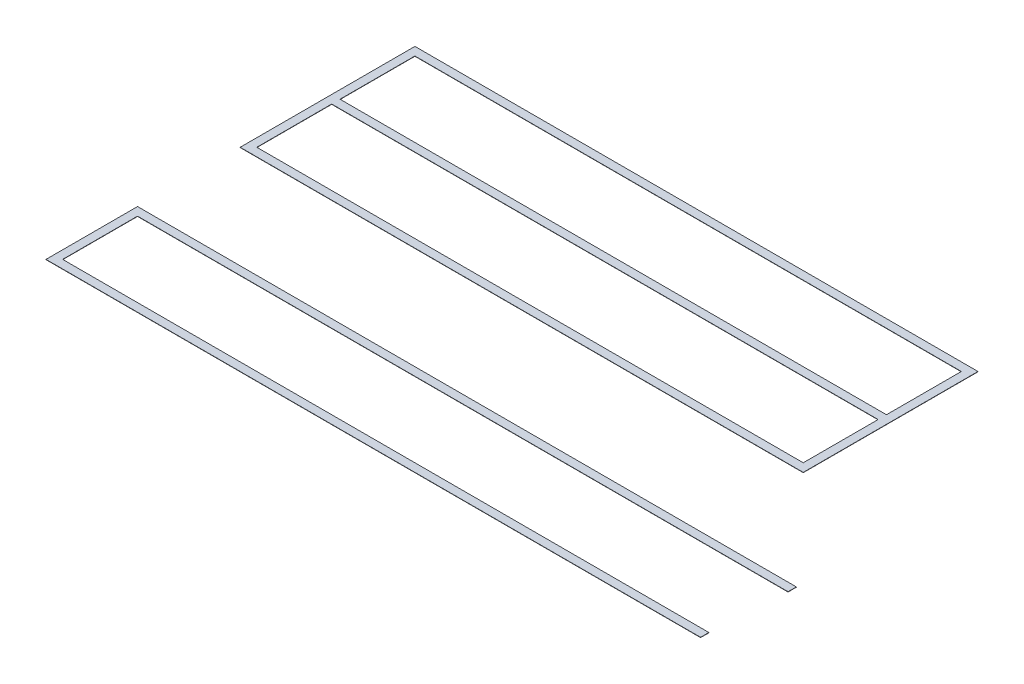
ISO-10303-21;
HEADER;
FILE_DESCRIPTION(('STEP AP214'),'2;1');
FILE_NAME('part.step','',(''),(''),'','','');
FILE_SCHEMA(('AUTOMOTIVE_DESIGN { 1 0 10303 214 1 1 1 1 }'));
ENDSEC;
DATA;
#1=APPLICATION_CONTEXT('core data for automotive mechanical design processes');
#2=APPLICATION_PROTOCOL_DEFINITION('international standard','automotive_design',2000,#1);
#3=PRODUCT_CONTEXT('',#1,'mechanical');
#4=PRODUCT('Part','Part','',(#3));
#5=PRODUCT_RELATED_PRODUCT_CATEGORY('part','',(#4));
#6=PRODUCT_DEFINITION_FORMATION('','',#4);
#7=PRODUCT_DEFINITION_CONTEXT('part definition',#1,'design');
#8=PRODUCT_DEFINITION('design','',#6,#7);
#9=PRODUCT_DEFINITION_SHAPE('','',#8);
#10=(LENGTH_UNIT() NAMED_UNIT(*) SI_UNIT(.MILLI.,.METRE.));
#11=(NAMED_UNIT(*) PLANE_ANGLE_UNIT() SI_UNIT($,.RADIAN.));
#12=(NAMED_UNIT(*) SI_UNIT($,.STERADIAN.) SOLID_ANGLE_UNIT());
#13=UNCERTAINTY_MEASURE_WITH_UNIT(LENGTH_MEASURE(1.E-05),#10,'distance_accuracy_value','');
#14=(GEOMETRIC_REPRESENTATION_CONTEXT(3) GLOBAL_UNCERTAINTY_ASSIGNED_CONTEXT((#13)) GLOBAL_UNIT_ASSIGNED_CONTEXT((#10,
#11,#12)) REPRESENTATION_CONTEXT('',''));
#15=CARTESIAN_POINT('',(0.,0.,0.));
#16=DIRECTION('',(0.,0.,1.));
#17=DIRECTION('',(1.,0.,0.));
#18=AXIS2_PLACEMENT_3D('',#15,#16,#17);
#19=CARTESIAN_POINT('',(-1015.,1.,185.));
#20=DIRECTION('',(1.,0.,0.));
#21=DIRECTION('',(0.,0.,-1.));
#22=AXIS2_PLACEMENT_3D('',#19,#20,#21);
#23=PLANE('',#22);
#24=DIRECTION('',(0.,0.,1.));
#25=VECTOR('',#24,1.);
#26=CARTESIAN_POINT('',(-1015.,0.,185.));
#27=LINE('',#26,#25);
#28=CARTESIAN_POINT('',(-1015.,0.,185.));
#29=VERTEX_POINT('',#28);
#30=CARTESIAN_POINT('',(-1015.,0.,515.));
#31=VERTEX_POINT('',#30);
#32=EDGE_CURVE('E104',#29,#31,#27,.T.);
#33=ORIENTED_EDGE('',*,*,#32,.T.);
#34=DIRECTION('',(0.,-1.,0.));
#35=VECTOR('',#34,1.);
#36=CARTESIAN_POINT('',(-1015.,1.,515.));
#37=LINE('',#36,#35);
#38=CARTESIAN_POINT('',(-1015.,1.,515.));
#39=VERTEX_POINT('',#38);
#40=EDGE_CURVE('E12',#39,#31,#37,.T.);
#41=ORIENTED_EDGE('',*,*,#40,.F.);
#42=DIRECTION('',(0.,0.,1.));
#43=VECTOR('',#42,1.);
#44=CARTESIAN_POINT('',(-1015.,1.,185.));
#45=LINE('',#44,#43);
#46=CARTESIAN_POINT('',(-1015.,1.,185.));
#47=VERTEX_POINT('',#46);
#48=EDGE_CURVE('E131',#47,#39,#45,.T.);
#49=ORIENTED_EDGE('',*,*,#48,.F.);
#50=DIRECTION('',(0.,-1.,0.));
#51=VECTOR('',#50,1.);
#52=CARTESIAN_POINT('',(-1015.,1.,185.));
#53=LINE('',#52,#51);
#54=EDGE_CURVE('E117',#47,#29,#53,.T.);
#55=ORIENTED_EDGE('',*,*,#54,.T.);
#56=EDGE_LOOP('',(#33,#41,#49,#55));
#57=FACE_BOUND('',#56,.T.);
#58=ADVANCED_FACE('F36',(#57),#23,.F.);
#59=CARTESIAN_POINT('',(-1015.,1.,515.));
#60=DIRECTION('',(0.,0.,-1.));
#61=DIRECTION('',(-1.,0.,0.));
#62=AXIS2_PLACEMENT_3D('',#59,#60,#61);
#63=PLANE('',#62);
#64=DIRECTION('',(1.,0.,0.));
#65=VECTOR('',#64,1.);
#66=CARTESIAN_POINT('',(-1015.,0.,515.));
#67=LINE('',#66,#65);
#68=CARTESIAN_POINT('',(1344.86822087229,0.,515.));
#69=VERTEX_POINT('',#68);
#70=EDGE_CURVE('E100',#31,#69,#67,.T.);
#71=ORIENTED_EDGE('',*,*,#70,.T.);
#72=DIRECTION('',(0.,-1.,0.));
#73=VECTOR('',#72,1.);
#74=CARTESIAN_POINT('',(1344.86822087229,1.,515.));
#75=LINE('',#74,#73);
#76=CARTESIAN_POINT('',(1344.86822087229,1.,515.));
#77=VERTEX_POINT('',#76);
#78=EDGE_CURVE('E43',#77,#69,#75,.T.);
#79=ORIENTED_EDGE('',*,*,#78,.F.);
#80=DIRECTION('',(1.,0.,0.));
#81=VECTOR('',#80,1.);
#82=CARTESIAN_POINT('',(-1015.,1.,515.));
#83=LINE('',#82,#81);
#84=EDGE_CURVE('E113',#39,#77,#83,.T.);
#85=ORIENTED_EDGE('',*,*,#84,.F.);
#86=ORIENTED_EDGE('',*,*,#40,.T.);
#87=EDGE_LOOP('',(#71,#79,#85,#86));
#88=FACE_BOUND('',#87,.T.);
#89=ADVANCED_FACE('F112',(#88),#63,.F.);
#90=CARTESIAN_POINT('',(1344.86822087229,1.,485.));
#91=DIRECTION('',(-1.,0.,0.));
#92=DIRECTION('',(0.,0.,1.));
#93=AXIS2_PLACEMENT_3D('',#90,#91,#92);
#94=PLANE('',#93);
#95=DIRECTION('',(0.,0.,-1.));
#96=VECTOR('',#95,1.);
#97=CARTESIAN_POINT('',(1344.86822087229,0.,485.));
#98=LINE('',#97,#96);
#99=CARTESIAN_POINT('',(1344.86822087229,0.,485.));
#100=VERTEX_POINT('',#99);
#101=EDGE_CURVE('E106',#69,#100,#98,.T.);
#102=ORIENTED_EDGE('',*,*,#101,.T.);
#103=DIRECTION('',(0.,-1.,0.));
#104=VECTOR('',#103,1.);
#105=CARTESIAN_POINT('',(1344.86822087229,1.,485.));
#106=LINE('',#105,#104);
#107=CARTESIAN_POINT('',(1344.86822087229,1.,485.));
#108=VERTEX_POINT('',#107);
#109=EDGE_CURVE('E157',#108,#100,#106,.T.);
#110=ORIENTED_EDGE('',*,*,#109,.F.);
#111=DIRECTION('',(0.,0.,-1.));
#112=VECTOR('',#111,1.);
#113=CARTESIAN_POINT('',(1344.86822087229,1.,485.));
#114=LINE('',#113,#112);
#115=EDGE_CURVE('E134',#77,#108,#114,.T.);
#116=ORIENTED_EDGE('',*,*,#115,.F.);
#117=ORIENTED_EDGE('',*,*,#78,.T.);
#118=EDGE_LOOP('',(#102,#110,#116,#117));
#119=FACE_BOUND('',#118,.T.);
#120=ADVANCED_FACE('F161',(#119),#94,.F.);
#121=CARTESIAN_POINT('',(-985.,1.,485.));
#122=DIRECTION('',(0.,0.,1.));
#123=DIRECTION('',(1.,0.,0.));
#124=AXIS2_PLACEMENT_3D('',#121,#122,#123);
#125=PLANE('',#124);
#126=DIRECTION('',(-1.,0.,0.));
#127=VECTOR('',#126,1.);
#128=CARTESIAN_POINT('',(-985.,0.,485.));
#129=LINE('',#128,#127);
#130=CARTESIAN_POINT('',(-985.,0.,485.));
#131=VERTEX_POINT('',#130);
#132=EDGE_CURVE('E121',#100,#131,#129,.T.);
#133=ORIENTED_EDGE('',*,*,#132,.T.);
#134=DIRECTION('',(0.,-1.,0.));
#135=VECTOR('',#134,1.);
#136=CARTESIAN_POINT('',(-985.,1.,485.));
#137=LINE('',#136,#135);
#138=CARTESIAN_POINT('',(-985.,1.,485.));
#139=VERTEX_POINT('',#138);
#140=EDGE_CURVE('E154',#139,#131,#137,.T.);
#141=ORIENTED_EDGE('',*,*,#140,.F.);
#142=DIRECTION('',(-1.,0.,0.));
#143=VECTOR('',#142,1.);
#144=CARTESIAN_POINT('',(-985.,1.,485.));
#145=LINE('',#144,#143);
#146=EDGE_CURVE('E136',#108,#139,#145,.T.);
#147=ORIENTED_EDGE('',*,*,#146,.F.);
#148=ORIENTED_EDGE('',*,*,#109,.T.);
#149=EDGE_LOOP('',(#133,#141,#147,#148));
#150=FACE_BOUND('',#149,.T.);
#151=ADVANCED_FACE('F169',(#150),#125,.F.);
#152=CARTESIAN_POINT('',(-985.,1.,215.));
#153=DIRECTION('',(-1.,0.,0.));
#154=DIRECTION('',(0.,0.,1.));
#155=AXIS2_PLACEMENT_3D('',#152,#153,#154);
#156=PLANE('',#155);
#157=DIRECTION('',(0.,0.,-1.));
#158=VECTOR('',#157,1.);
#159=CARTESIAN_POINT('',(-985.,0.,215.));
#160=LINE('',#159,#158);
#161=CARTESIAN_POINT('',(-985.,0.,215.));
#162=VERTEX_POINT('',#161);
#163=EDGE_CURVE('E123',#131,#162,#160,.T.);
#164=ORIENTED_EDGE('',*,*,#163,.T.);
#165=DIRECTION('',(0.,-1.,0.));
#166=VECTOR('',#165,1.);
#167=CARTESIAN_POINT('',(-985.,1.,215.));
#168=LINE('',#167,#166);
#169=CARTESIAN_POINT('',(-985.,1.,215.));
#170=VERTEX_POINT('',#169);
#171=EDGE_CURVE('E151',#170,#162,#168,.T.);
#172=ORIENTED_EDGE('',*,*,#171,.F.);
#173=DIRECTION('',(0.,0.,-1.));
#174=VECTOR('',#173,1.);
#175=CARTESIAN_POINT('',(-985.,1.,215.));
#176=LINE('',#175,#174);
#177=EDGE_CURVE('E138',#139,#170,#176,.T.);
#178=ORIENTED_EDGE('',*,*,#177,.F.);
#179=ORIENTED_EDGE('',*,*,#140,.T.);
#180=EDGE_LOOP('',(#164,#172,#178,#179));
#181=FACE_BOUND('',#180,.T.);
#182=ADVANCED_FACE('F172',(#181),#156,.F.);
#183=CARTESIAN_POINT('',(-985.,1.,215.));
#184=DIRECTION('',(0.,0.,-1.));
#185=DIRECTION('',(-1.,0.,0.));
#186=AXIS2_PLACEMENT_3D('',#183,#184,#185);
#187=PLANE('',#186);
#188=DIRECTION('',(1.,0.,0.));
#189=VECTOR('',#188,1.);
#190=CARTESIAN_POINT('',(-985.,0.,215.));
#191=LINE('',#190,#189);
#192=CARTESIAN_POINT('',(1360.21962436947,0.,215.));
#193=VERTEX_POINT('',#192);
#194=EDGE_CURVE('E125',#162,#193,#191,.T.);
#195=ORIENTED_EDGE('',*,*,#194,.T.);
#196=DIRECTION('',(0.,-1.,0.));
#197=VECTOR('',#196,1.);
#198=CARTESIAN_POINT('',(1360.21962436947,1.,215.));
#199=LINE('',#198,#197);
#200=CARTESIAN_POINT('',(1360.21962436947,1.,215.));
#201=VERTEX_POINT('',#200);
#202=EDGE_CURVE('E148',#201,#193,#199,.T.);
#203=ORIENTED_EDGE('',*,*,#202,.F.);
#204=DIRECTION('',(1.,0.,0.));
#205=VECTOR('',#204,1.);
#206=CARTESIAN_POINT('',(-985.,1.,215.));
#207=LINE('',#206,#205);
#208=EDGE_CURVE('E140',#170,#201,#207,.T.);
#209=ORIENTED_EDGE('',*,*,#208,.F.);
#210=ORIENTED_EDGE('',*,*,#171,.T.);
#211=EDGE_LOOP('',(#195,#203,#209,#210));
#212=FACE_BOUND('',#211,.T.);
#213=ADVANCED_FACE('F177',(#212),#187,.F.);
#214=CARTESIAN_POINT('',(1360.21962436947,1.,185.));
#215=DIRECTION('',(-1.,0.,0.));
#216=DIRECTION('',(0.,0.,1.));
#217=AXIS2_PLACEMENT_3D('',#214,#215,#216);
#218=PLANE('',#217);
#219=DIRECTION('',(0.,0.,-1.));
#220=VECTOR('',#219,1.);
#221=CARTESIAN_POINT('',(1360.21962436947,0.,185.));
#222=LINE('',#221,#220);
#223=CARTESIAN_POINT('',(1360.21962436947,0.,185.));
#224=VERTEX_POINT('',#223);
#225=EDGE_CURVE('E127',#193,#224,#222,.T.);
#226=ORIENTED_EDGE('',*,*,#225,.T.);
#227=DIRECTION('',(0.,-1.,0.));
#228=VECTOR('',#227,1.);
#229=CARTESIAN_POINT('',(1360.21962436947,1.,185.));
#230=LINE('',#229,#228);
#231=CARTESIAN_POINT('',(1360.21962436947,1.,185.));
#232=VERTEX_POINT('',#231);
#233=EDGE_CURVE('E145',#232,#224,#230,.T.);
#234=ORIENTED_EDGE('',*,*,#233,.F.);
#235=DIRECTION('',(0.,0.,-1.));
#236=VECTOR('',#235,1.);
#237=CARTESIAN_POINT('',(1360.21962436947,1.,185.));
#238=LINE('',#237,#236);
#239=EDGE_CURVE('E55',#201,#232,#238,.T.);
#240=ORIENTED_EDGE('',*,*,#239,.F.);
#241=ORIENTED_EDGE('',*,*,#202,.T.);
#242=EDGE_LOOP('',(#226,#234,#240,#241));
#243=FACE_BOUND('',#242,.T.);
#244=ADVANCED_FACE('F180',(#243),#218,.F.);
#245=CARTESIAN_POINT('',(-1015.,1.,185.));
#246=DIRECTION('',(0.,0.,1.));
#247=DIRECTION('',(1.,0.,0.));
#248=AXIS2_PLACEMENT_3D('',#245,#246,#247);
#249=PLANE('',#248);
#250=DIRECTION('',(-1.,0.,0.));
#251=VECTOR('',#250,1.);
#252=CARTESIAN_POINT('',(-1015.,0.,185.));
#253=LINE('',#252,#251);
#254=EDGE_CURVE('E129',#224,#29,#253,.T.);
#255=ORIENTED_EDGE('',*,*,#254,.T.);
#256=ORIENTED_EDGE('',*,*,#54,.F.);
#257=DIRECTION('',(-1.,0.,0.));
#258=VECTOR('',#257,1.);
#259=CARTESIAN_POINT('',(-1015.,1.,185.));
#260=LINE('',#259,#258);
#261=EDGE_CURVE('E50',#232,#47,#260,.T.);
#262=ORIENTED_EDGE('',*,*,#261,.F.);
#263=ORIENTED_EDGE('',*,*,#233,.T.);
#264=EDGE_LOOP('',(#255,#256,#262,#263));
#265=FACE_BOUND('',#264,.T.);
#266=ADVANCED_FACE('F182',(#265),#249,.F.);
#267=CARTESIAN_POINT('',(-1015.,1.,515.));
#268=DIRECTION('',(0.,1.,0.));
#269=DIRECTION('',(0.,0.,1.));
#270=AXIS2_PLACEMENT_3D('',#267,#268,#269);
#271=PLANE('',#270);
#272=ORIENTED_EDGE('',*,*,#48,.T.);
#273=ORIENTED_EDGE('',*,*,#84,.T.);
#274=ORIENTED_EDGE('',*,*,#115,.T.);
#275=ORIENTED_EDGE('',*,*,#146,.T.);
#276=ORIENTED_EDGE('',*,*,#177,.T.);
#277=ORIENTED_EDGE('',*,*,#208,.T.);
#278=ORIENTED_EDGE('',*,*,#239,.T.);
#279=ORIENTED_EDGE('',*,*,#261,.T.);
#280=EDGE_LOOP('',(#272,#273,#274,#275,#276,#277,#278,#279));
#281=FACE_BOUND('',#280,.T.);
#282=ADVANCED_FACE('F164',(#281),#271,.T.);
#283=CARTESIAN_POINT('',(-1015.,0.,515.));
#284=DIRECTION('',(0.,1.,0.));
#285=DIRECTION('',(0.,0.,1.));
#286=AXIS2_PLACEMENT_3D('',#283,#284,#285);
#287=PLANE('',#286);
#288=ORIENTED_EDGE('',*,*,#32,.F.);
#289=ORIENTED_EDGE('',*,*,#254,.F.);
#290=ORIENTED_EDGE('',*,*,#225,.F.);
#291=ORIENTED_EDGE('',*,*,#194,.F.);
#292=ORIENTED_EDGE('',*,*,#163,.F.);
#293=ORIENTED_EDGE('',*,*,#132,.F.);
#294=ORIENTED_EDGE('',*,*,#101,.F.);
#295=ORIENTED_EDGE('',*,*,#70,.F.);
#296=EDGE_LOOP('',(#288,#289,#290,#291,#292,#293,#294,#295));
#297=FACE_BOUND('',#296,.T.);
#298=ADVANCED_FACE('F101',(#297),#287,.F.);
#299=CLOSED_SHELL('',(#58,#89,#120,#151,#182,#213,#244,#266,#282,#298));
#300=MANIFOLD_SOLID_BREP('B2',#299);
#301=CARTESIAN_POINT('',(-1015.,1.,-815.));
#302=DIRECTION('',(0.,1.,0.));
#303=DIRECTION('',(0.,0.,1.));
#304=AXIS2_PLACEMENT_3D('',#301,#302,#303);
#305=PLANE('',#304);
#306=DIRECTION('',(1.,0.,0.));
#307=VECTOR('',#306,1.);
#308=CARTESIAN_POINT('',(-985.,1.,-515.));
#309=LINE('',#308,#307);
#310=CARTESIAN_POINT('',(-985.,1.,-515.));
#311=VERTEX_POINT('',#310);
#312=CARTESIAN_POINT('',(985.,1.,-515.));
#313=VERTEX_POINT('',#312);
#314=EDGE_CURVE('E387',#311,#313,#309,.T.);
#315=ORIENTED_EDGE('',*,*,#314,.F.);
#316=DIRECTION('',(0.,0.,1.));
#317=VECTOR('',#316,1.);
#318=CARTESIAN_POINT('',(-985.,1.,-785.));
#319=LINE('',#318,#317);
#320=CARTESIAN_POINT('',(-985.,1.,-785.));
#321=VERTEX_POINT('',#320);
#322=EDGE_CURVE('E385',#321,#311,#319,.T.);
#323=ORIENTED_EDGE('',*,*,#322,.F.);
#324=DIRECTION('',(-1.,0.,0.));
#325=VECTOR('',#324,1.);
#326=CARTESIAN_POINT('',(-985.,1.,-785.));
#327=LINE('',#326,#325);
#328=CARTESIAN_POINT('',(985.,1.,-785.));
#329=VERTEX_POINT('',#328);
#330=EDGE_CURVE('E392',#329,#321,#327,.T.);
#331=ORIENTED_EDGE('',*,*,#330,.F.);
#332=DIRECTION('',(0.,0.,-1.));
#333=VECTOR('',#332,1.);
#334=CARTESIAN_POINT('',(985.,1.,-785.));
#335=LINE('',#334,#333);
#336=EDGE_CURVE('E389',#313,#329,#335,.T.);
#337=ORIENTED_EDGE('',*,*,#336,.F.);
#338=EDGE_LOOP('',(#315,#323,#331,#337));
#339=FACE_BOUND('',#338,.T.);
#340=DIRECTION('',(0.,0.,1.));
#341=VECTOR('',#340,1.);
#342=CARTESIAN_POINT('',(-1015.,1.,-815.));
#343=LINE('',#342,#341);
#344=CARTESIAN_POINT('',(-1015.,1.,-815.));
#345=VERTEX_POINT('',#344);
#346=CARTESIAN_POINT('',(-1015.,1.,-185.));
#347=VERTEX_POINT('',#346);
#348=EDGE_CURVE('E413',#345,#347,#343,.T.);
#349=ORIENTED_EDGE('',*,*,#348,.T.);
#350=DIRECTION('',(1.,0.,0.));
#351=VECTOR('',#350,1.);
#352=CARTESIAN_POINT('',(-1015.,1.,-185.));
#353=LINE('',#352,#351);
#354=CARTESIAN_POINT('',(1015.,1.,-185.));
#355=VERTEX_POINT('',#354);
#356=EDGE_CURVE('E416',#347,#355,#353,.T.);
#357=ORIENTED_EDGE('',*,*,#356,.T.);
#358=DIRECTION('',(0.,0.,-1.));
#359=VECTOR('',#358,1.);
#360=CARTESIAN_POINT('',(1015.,1.,-815.));
#361=LINE('',#360,#359);
#362=CARTESIAN_POINT('',(1015.,1.,-815.));
#363=VERTEX_POINT('',#362);
#364=EDGE_CURVE('E418',#355,#363,#361,.T.);
#365=ORIENTED_EDGE('',*,*,#364,.T.);
#366=DIRECTION('',(-1.,0.,0.));
#367=VECTOR('',#366,1.);
#368=CARTESIAN_POINT('',(-1015.,1.,-815.));
#369=LINE('',#368,#367);
#370=EDGE_CURVE('E420',#363,#345,#369,.T.);
#371=ORIENTED_EDGE('',*,*,#370,.T.);
#372=EDGE_LOOP('',(#349,#357,#365,#371));
#373=FACE_BOUND('',#372,.T.);
#374=DIRECTION('',(0.,0.,1.));
#375=VECTOR('',#374,1.);
#376=CARTESIAN_POINT('',(-985.,1.,-485.));
#377=LINE('',#376,#375);
#378=CARTESIAN_POINT('',(-985.,1.,-485.));
#379=VERTEX_POINT('',#378);
#380=CARTESIAN_POINT('',(-985.,1.,-215.));
#381=VERTEX_POINT('',#380);
#382=EDGE_CURVE('E364',#379,#381,#377,.T.);
#383=ORIENTED_EDGE('',*,*,#382,.F.);
#384=DIRECTION('',(-1.,0.,0.));
#385=VECTOR('',#384,1.);
#386=CARTESIAN_POINT('',(-985.,1.,-485.));
#387=LINE('',#386,#385);
#388=CARTESIAN_POINT('',(985.,1.,-485.));
#389=VERTEX_POINT('',#388);
#390=EDGE_CURVE('E353',#389,#379,#387,.T.);
#391=ORIENTED_EDGE('',*,*,#390,.F.);
#392=DIRECTION('',(0.,0.,-1.));
#393=VECTOR('',#392,1.);
#394=CARTESIAN_POINT('',(985.,1.,-485.));
#395=LINE('',#394,#393);
#396=CARTESIAN_POINT('',(985.,1.,-215.));
#397=VERTEX_POINT('',#396);
#398=EDGE_CURVE('E368',#397,#389,#395,.T.);
#399=ORIENTED_EDGE('',*,*,#398,.F.);
#400=DIRECTION('',(1.,0.,0.));
#401=VECTOR('',#400,1.);
#402=CARTESIAN_POINT('',(-985.,1.,-215.));
#403=LINE('',#402,#401);
#404=EDGE_CURVE('E366',#381,#397,#403,.T.);
#405=ORIENTED_EDGE('',*,*,#404,.F.);
#406=EDGE_LOOP('',(#383,#391,#399,#405));
#407=FACE_BOUND('',#406,.T.);
#408=ADVANCED_FACE('F249',(#339,#373,#407),#305,.T.);
#409=CARTESIAN_POINT('',(-1015.,0.,-815.));
#410=DIRECTION('',(0.,1.,0.));
#411=DIRECTION('',(0.,0.,1.));
#412=AXIS2_PLACEMENT_3D('',#409,#410,#411);
#413=PLANE('',#412);
#414=DIRECTION('',(0.,0.,1.));
#415=VECTOR('',#414,1.);
#416=CARTESIAN_POINT('',(-985.,0.,-785.));
#417=LINE('',#416,#415);
#418=CARTESIAN_POINT('',(-985.,0.,-785.));
#419=VERTEX_POINT('',#418);
#420=CARTESIAN_POINT('',(-985.,0.,-515.));
#421=VERTEX_POINT('',#420);
#422=EDGE_CURVE('E354',#419,#421,#417,.T.);
#423=ORIENTED_EDGE('',*,*,#422,.T.);
#424=DIRECTION('',(1.,0.,0.));
#425=VECTOR('',#424,1.);
#426=CARTESIAN_POINT('',(-985.,0.,-515.));
#427=LINE('',#426,#425);
#428=CARTESIAN_POINT('',(985.,0.,-515.));
#429=VERTEX_POINT('',#428);
#430=EDGE_CURVE('E376',#421,#429,#427,.T.);
#431=ORIENTED_EDGE('',*,*,#430,.T.);
#432=DIRECTION('',(0.,0.,-1.));
#433=VECTOR('',#432,1.);
#434=CARTESIAN_POINT('',(985.,0.,-785.));
#435=LINE('',#434,#433);
#436=CARTESIAN_POINT('',(985.,0.,-785.));
#437=VERTEX_POINT('',#436);
#438=EDGE_CURVE('E379',#429,#437,#435,.T.);
#439=ORIENTED_EDGE('',*,*,#438,.T.);
#440=DIRECTION('',(-1.,0.,0.));
#441=VECTOR('',#440,1.);
#442=CARTESIAN_POINT('',(-985.,0.,-785.));
#443=LINE('',#442,#441);
#444=EDGE_CURVE('E382',#437,#419,#443,.T.);
#445=ORIENTED_EDGE('',*,*,#444,.T.);
#446=EDGE_LOOP('',(#423,#431,#439,#445));
#447=FACE_BOUND('',#446,.T.);
#448=DIRECTION('',(0.,0.,1.));
#449=VECTOR('',#448,1.);
#450=CARTESIAN_POINT('',(-1015.,0.,-815.));
#451=LINE('',#450,#449);
#452=CARTESIAN_POINT('',(-1015.,0.,-815.));
#453=VERTEX_POINT('',#452);
#454=CARTESIAN_POINT('',(-1015.,0.,-185.));
#455=VERTEX_POINT('',#454);
#456=EDGE_CURVE('E404',#453,#455,#451,.T.);
#457=ORIENTED_EDGE('',*,*,#456,.F.);
#458=DIRECTION('',(-1.,0.,0.));
#459=VECTOR('',#458,1.);
#460=CARTESIAN_POINT('',(-1015.,0.,-815.));
#461=LINE('',#460,#459);
#462=CARTESIAN_POINT('',(1015.,0.,-815.));
#463=VERTEX_POINT('',#462);
#464=EDGE_CURVE('E411',#463,#453,#461,.T.);
#465=ORIENTED_EDGE('',*,*,#464,.F.);
#466=DIRECTION('',(0.,0.,-1.));
#467=VECTOR('',#466,1.);
#468=CARTESIAN_POINT('',(1015.,0.,-815.));
#469=LINE('',#468,#467);
#470=CARTESIAN_POINT('',(1015.,0.,-185.));
#471=VERTEX_POINT('',#470);
#472=EDGE_CURVE('E409',#471,#463,#469,.T.);
#473=ORIENTED_EDGE('',*,*,#472,.F.);
#474=DIRECTION('',(1.,0.,0.));
#475=VECTOR('',#474,1.);
#476=CARTESIAN_POINT('',(-1015.,0.,-185.));
#477=LINE('',#476,#475);
#478=EDGE_CURVE('E407',#455,#471,#477,.T.);
#479=ORIENTED_EDGE('',*,*,#478,.F.);
#480=EDGE_LOOP('',(#457,#465,#473,#479));
#481=FACE_BOUND('',#480,.T.);
#482=DIRECTION('',(-1.,0.,0.));
#483=VECTOR('',#482,1.);
#484=CARTESIAN_POINT('',(-985.,0.,-485.));
#485=LINE('',#484,#483);
#486=CARTESIAN_POINT('',(985.,0.,-485.));
#487=VERTEX_POINT('',#486);
#488=CARTESIAN_POINT('',(-985.,0.,-485.));
#489=VERTEX_POINT('',#488);
#490=EDGE_CURVE('E272',#487,#489,#485,.T.);
#491=ORIENTED_EDGE('',*,*,#490,.T.);
#492=DIRECTION('',(0.,0.,1.));
#493=VECTOR('',#492,1.);
#494=CARTESIAN_POINT('',(-985.,0.,-485.));
#495=LINE('',#494,#493);
#496=CARTESIAN_POINT('',(-985.,0.,-215.));
#497=VERTEX_POINT('',#496);
#498=EDGE_CURVE('E340',#489,#497,#495,.T.);
#499=ORIENTED_EDGE('',*,*,#498,.T.);
#500=DIRECTION('',(1.,0.,0.));
#501=VECTOR('',#500,1.);
#502=CARTESIAN_POINT('',(-985.,0.,-215.));
#503=LINE('',#502,#501);
#504=CARTESIAN_POINT('',(985.,0.,-215.));
#505=VERTEX_POINT('',#504);
#506=EDGE_CURVE('E349',#497,#505,#503,.T.);
#507=ORIENTED_EDGE('',*,*,#506,.T.);
#508=DIRECTION('',(0.,0.,-1.));
#509=VECTOR('',#508,1.);
#510=CARTESIAN_POINT('',(985.,0.,-485.));
#511=LINE('',#510,#509);
#512=EDGE_CURVE('E358',#505,#487,#511,.T.);
#513=ORIENTED_EDGE('',*,*,#512,.T.);
#514=EDGE_LOOP('',(#491,#499,#507,#513));
#515=FACE_BOUND('',#514,.T.);
#516=ADVANCED_FACE('F357',(#447,#481,#515),#413,.F.);
#517=CARTESIAN_POINT('',(-1015.,1.,-815.));
#518=DIRECTION('',(1.,0.,0.));
#519=DIRECTION('',(0.,0.,-1.));
#520=AXIS2_PLACEMENT_3D('',#517,#518,#519);
#521=PLANE('',#520);
#522=ORIENTED_EDGE('',*,*,#456,.T.);
#523=DIRECTION('',(0.,-1.,0.));
#524=VECTOR('',#523,1.);
#525=CARTESIAN_POINT('',(-1015.,1.,-185.));
#526=LINE('',#525,#524);
#527=EDGE_CURVE('E34',#347,#455,#526,.T.);
#528=ORIENTED_EDGE('',*,*,#527,.F.);
#529=ORIENTED_EDGE('',*,*,#348,.F.);
#530=DIRECTION('',(0.,-1.,0.));
#531=VECTOR('',#530,1.);
#532=CARTESIAN_POINT('',(-1015.,1.,-815.));
#533=LINE('',#532,#531);
#534=EDGE_CURVE('E422',#345,#453,#533,.T.);
#535=ORIENTED_EDGE('',*,*,#534,.T.);
#536=EDGE_LOOP('',(#522,#528,#529,#535));
#537=FACE_BOUND('',#536,.T.);
#538=ADVANCED_FACE('F251',(#537),#521,.F.);
#539=CARTESIAN_POINT('',(-1015.,1.,-185.));
#540=DIRECTION('',(0.,0.,-1.));
#541=DIRECTION('',(-1.,0.,0.));
#542=AXIS2_PLACEMENT_3D('',#539,#540,#541);
#543=PLANE('',#542);
#544=ORIENTED_EDGE('',*,*,#478,.T.);
#545=DIRECTION('',(0.,-1.,0.));
#546=VECTOR('',#545,1.);
#547=CARTESIAN_POINT('',(1015.,1.,-185.));
#548=LINE('',#547,#546);
#549=EDGE_CURVE('E257',#355,#471,#548,.T.);
#550=ORIENTED_EDGE('',*,*,#549,.F.);
#551=ORIENTED_EDGE('',*,*,#356,.F.);
#552=ORIENTED_EDGE('',*,*,#527,.T.);
#553=EDGE_LOOP('',(#544,#550,#551,#552));
#554=FACE_BOUND('',#553,.T.);
#555=ADVANCED_FACE('F447',(#554),#543,.F.);
#556=CARTESIAN_POINT('',(1015.,1.,-815.));
#557=DIRECTION('',(-1.,0.,0.));
#558=DIRECTION('',(0.,0.,1.));
#559=AXIS2_PLACEMENT_3D('',#556,#557,#558);
#560=PLANE('',#559);
#561=ORIENTED_EDGE('',*,*,#472,.T.);
#562=DIRECTION('',(0.,-1.,0.));
#563=VECTOR('',#562,1.);
#564=CARTESIAN_POINT('',(1015.,1.,-815.));
#565=LINE('',#564,#563);
#566=EDGE_CURVE('E425',#363,#463,#565,.T.);
#567=ORIENTED_EDGE('',*,*,#566,.F.);
#568=ORIENTED_EDGE('',*,*,#364,.F.);
#569=ORIENTED_EDGE('',*,*,#549,.T.);
#570=EDGE_LOOP('',(#561,#567,#568,#569));
#571=FACE_BOUND('',#570,.T.);
#572=ADVANCED_FACE('F432',(#571),#560,.F.);
#573=CARTESIAN_POINT('',(-1015.,1.,-815.));
#574=DIRECTION('',(0.,0.,1.));
#575=DIRECTION('',(1.,0.,0.));
#576=AXIS2_PLACEMENT_3D('',#573,#574,#575);
#577=PLANE('',#576);
#578=ORIENTED_EDGE('',*,*,#464,.T.);
#579=ORIENTED_EDGE('',*,*,#534,.F.);
#580=ORIENTED_EDGE('',*,*,#370,.F.);
#581=ORIENTED_EDGE('',*,*,#566,.T.);
#582=EDGE_LOOP('',(#578,#579,#580,#581));
#583=FACE_BOUND('',#582,.T.);
#584=ADVANCED_FACE('F440',(#583),#577,.F.);
#585=CARTESIAN_POINT('',(-985.,1.,-785.));
#586=DIRECTION('',(1.,0.,0.));
#587=DIRECTION('',(0.,0.,-1.));
#588=AXIS2_PLACEMENT_3D('',#585,#586,#587);
#589=PLANE('',#588);
#590=ORIENTED_EDGE('',*,*,#422,.F.);
#591=DIRECTION('',(0.,-1.,0.));
#592=VECTOR('',#591,1.);
#593=CARTESIAN_POINT('',(-985.,1.,-785.));
#594=LINE('',#593,#592);
#595=EDGE_CURVE('E394',#321,#419,#594,.T.);
#596=ORIENTED_EDGE('',*,*,#595,.F.);
#597=ORIENTED_EDGE('',*,*,#322,.T.);
#598=DIRECTION('',(0.,-1.,0.));
#599=VECTOR('',#598,1.);
#600=CARTESIAN_POINT('',(-985.,1.,-515.));
#601=LINE('',#600,#599);
#602=EDGE_CURVE('E401',#311,#421,#601,.T.);
#603=ORIENTED_EDGE('',*,*,#602,.T.);
#604=EDGE_LOOP('',(#590,#596,#597,#603));
#605=FACE_BOUND('',#604,.T.);
#606=ADVANCED_FACE('F466',(#605),#589,.T.);
#607=CARTESIAN_POINT('',(-985.,1.,-515.));
#608=DIRECTION('',(0.,0.,-1.));
#609=DIRECTION('',(-1.,0.,0.));
#610=AXIS2_PLACEMENT_3D('',#607,#608,#609);
#611=PLANE('',#610);
#612=ORIENTED_EDGE('',*,*,#430,.F.);
#613=ORIENTED_EDGE('',*,*,#602,.F.);
#614=ORIENTED_EDGE('',*,*,#314,.T.);
#615=DIRECTION('',(0.,-1.,0.));
#616=VECTOR('',#615,1.);
#617=CARTESIAN_POINT('',(985.,1.,-515.));
#618=LINE('',#617,#616);
#619=EDGE_CURVE('E399',#313,#429,#618,.T.);
#620=ORIENTED_EDGE('',*,*,#619,.T.);
#621=EDGE_LOOP('',(#612,#613,#614,#620));
#622=FACE_BOUND('',#621,.T.);
#623=ADVANCED_FACE('F470',(#622),#611,.T.);
#624=CARTESIAN_POINT('',(985.,1.,-785.));
#625=DIRECTION('',(-1.,0.,0.));
#626=DIRECTION('',(0.,0.,1.));
#627=AXIS2_PLACEMENT_3D('',#624,#625,#626);
#628=PLANE('',#627);
#629=ORIENTED_EDGE('',*,*,#438,.F.);
#630=ORIENTED_EDGE('',*,*,#619,.F.);
#631=ORIENTED_EDGE('',*,*,#336,.T.);
#632=DIRECTION('',(0.,-1.,0.));
#633=VECTOR('',#632,1.);
#634=CARTESIAN_POINT('',(985.,1.,-785.));
#635=LINE('',#634,#633);
#636=EDGE_CURVE('E397',#329,#437,#635,.T.);
#637=ORIENTED_EDGE('',*,*,#636,.T.);
#638=EDGE_LOOP('',(#629,#630,#631,#637));
#639=FACE_BOUND('',#638,.T.);
#640=ADVANCED_FACE('F475',(#639),#628,.T.);
#641=CARTESIAN_POINT('',(-985.,1.,-785.));
#642=DIRECTION('',(0.,0.,1.));
#643=DIRECTION('',(1.,0.,0.));
#644=AXIS2_PLACEMENT_3D('',#641,#642,#643);
#645=PLANE('',#644);
#646=ORIENTED_EDGE('',*,*,#444,.F.);
#647=ORIENTED_EDGE('',*,*,#636,.F.);
#648=ORIENTED_EDGE('',*,*,#330,.T.);
#649=ORIENTED_EDGE('',*,*,#595,.T.);
#650=EDGE_LOOP('',(#646,#647,#648,#649));
#651=FACE_BOUND('',#650,.T.);
#652=ADVANCED_FACE('F481',(#651),#645,.T.);
#653=CARTESIAN_POINT('',(-985.,1.,-485.));
#654=DIRECTION('',(0.,0.,1.));
#655=DIRECTION('',(1.,0.,0.));
#656=AXIS2_PLACEMENT_3D('',#653,#654,#655);
#657=PLANE('',#656);
#658=ORIENTED_EDGE('',*,*,#490,.F.);
#659=DIRECTION('',(0.,-1.,0.));
#660=VECTOR('',#659,1.);
#661=CARTESIAN_POINT('',(985.,1.,-485.));
#662=LINE('',#661,#660);
#663=EDGE_CURVE('E370',#389,#487,#662,.T.);
#664=ORIENTED_EDGE('',*,*,#663,.F.);
#665=ORIENTED_EDGE('',*,*,#390,.T.);
#666=DIRECTION('',(0.,-1.,0.));
#667=VECTOR('',#666,1.);
#668=CARTESIAN_POINT('',(-985.,1.,-485.));
#669=LINE('',#668,#667);
#670=EDGE_CURVE('E342',#379,#489,#669,.T.);
#671=ORIENTED_EDGE('',*,*,#670,.T.);
#672=EDGE_LOOP('',(#658,#664,#665,#671));
#673=FACE_BOUND('',#672,.T.);
#674=ADVANCED_FACE('F351',(#673),#657,.T.);
#675=CARTESIAN_POINT('',(-985.,1.,-485.));
#676=DIRECTION('',(1.,0.,0.));
#677=DIRECTION('',(0.,0.,-1.));
#678=AXIS2_PLACEMENT_3D('',#675,#676,#677);
#679=PLANE('',#678);
#680=ORIENTED_EDGE('',*,*,#498,.F.);
#681=ORIENTED_EDGE('',*,*,#670,.F.);
#682=ORIENTED_EDGE('',*,*,#382,.T.);
#683=DIRECTION('',(0.,-1.,0.));
#684=VECTOR('',#683,1.);
#685=CARTESIAN_POINT('',(-985.,1.,-215.));
#686=LINE('',#685,#684);
#687=EDGE_CURVE('E345',#381,#497,#686,.T.);
#688=ORIENTED_EDGE('',*,*,#687,.T.);
#689=EDGE_LOOP('',(#680,#681,#682,#688));
#690=FACE_BOUND('',#689,.T.);
#691=ADVANCED_FACE('F341',(#690),#679,.T.);
#692=CARTESIAN_POINT('',(-985.,1.,-215.));
#693=DIRECTION('',(0.,0.,-1.));
#694=DIRECTION('',(-1.,0.,0.));
#695=AXIS2_PLACEMENT_3D('',#692,#693,#694);
#696=PLANE('',#695);
#697=ORIENTED_EDGE('',*,*,#506,.F.);
#698=ORIENTED_EDGE('',*,*,#687,.F.);
#699=ORIENTED_EDGE('',*,*,#404,.T.);
#700=DIRECTION('',(0.,-1.,0.));
#701=VECTOR('',#700,1.);
#702=CARTESIAN_POINT('',(985.,1.,-215.));
#703=LINE('',#702,#701);
#704=EDGE_CURVE('E264',#397,#505,#703,.T.);
#705=ORIENTED_EDGE('',*,*,#704,.T.);
#706=EDGE_LOOP('',(#697,#698,#699,#705));
#707=FACE_BOUND('',#706,.T.);
#708=ADVANCED_FACE('F490',(#707),#696,.T.);
#709=CARTESIAN_POINT('',(985.,1.,-485.));
#710=DIRECTION('',(-1.,0.,0.));
#711=DIRECTION('',(0.,0.,1.));
#712=AXIS2_PLACEMENT_3D('',#709,#710,#711);
#713=PLANE('',#712);
#714=ORIENTED_EDGE('',*,*,#512,.F.);
#715=ORIENTED_EDGE('',*,*,#704,.F.);
#716=ORIENTED_EDGE('',*,*,#398,.T.);
#717=ORIENTED_EDGE('',*,*,#663,.T.);
#718=EDGE_LOOP('',(#714,#715,#716,#717));
#719=FACE_BOUND('',#718,.T.);
#720=ADVANCED_FACE('F493',(#719),#713,.T.);
#721=CLOSED_SHELL('',(#408,#516,#538,#555,#572,#584,#606,#623,#640,#652,#674,#691,#708,#720));
#722=MANIFOLD_SOLID_BREP('B6',#721);
#723=ADVANCED_BREP_SHAPE_REPRESENTATION('',(#18,#300,#722),#14);
#724=SHAPE_DEFINITION_REPRESENTATION(#9,#723);
ENDSEC;
END-ISO-10303-21;
